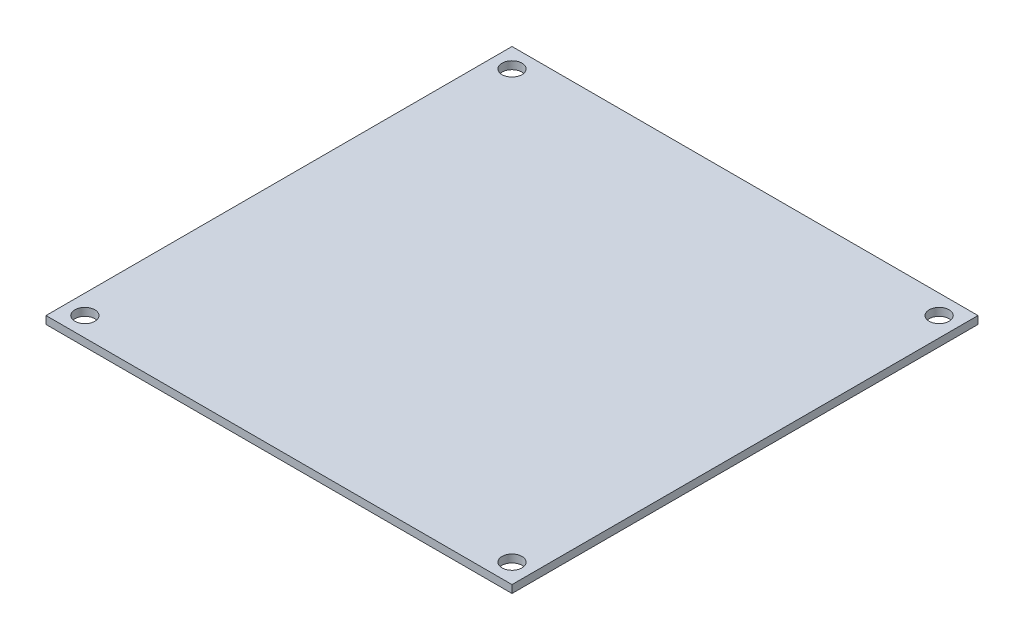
ISO-10303-21;
HEADER;
FILE_DESCRIPTION(('STEP AP214'),'2;1');
FILE_NAME('part.step','',(''),(''),'','','');
FILE_SCHEMA(('AUTOMOTIVE_DESIGN { 1 0 10303 214 1 1 1 1 }'));
ENDSEC;
DATA;
#1=APPLICATION_CONTEXT('core data for automotive mechanical design processes');
#2=APPLICATION_PROTOCOL_DEFINITION('international standard','automotive_design',2000,#1);
#3=PRODUCT_CONTEXT('',#1,'mechanical');
#4=PRODUCT('Part','Part','',(#3));
#5=PRODUCT_RELATED_PRODUCT_CATEGORY('part','',(#4));
#6=PRODUCT_DEFINITION_FORMATION('','',#4);
#7=PRODUCT_DEFINITION_CONTEXT('part definition',#1,'design');
#8=PRODUCT_DEFINITION('design','',#6,#7);
#9=PRODUCT_DEFINITION_SHAPE('','',#8);
#10=(LENGTH_UNIT() NAMED_UNIT(*) SI_UNIT(.MILLI.,.METRE.));
#11=(NAMED_UNIT(*) PLANE_ANGLE_UNIT() SI_UNIT($,.RADIAN.));
#12=(NAMED_UNIT(*) SI_UNIT($,.STERADIAN.) SOLID_ANGLE_UNIT());
#13=UNCERTAINTY_MEASURE_WITH_UNIT(LENGTH_MEASURE(1.E-05),#10,'distance_accuracy_value','');
#14=(GEOMETRIC_REPRESENTATION_CONTEXT(3) GLOBAL_UNCERTAINTY_ASSIGNED_CONTEXT((#13)) GLOBAL_UNIT_ASSIGNED_CONTEXT((#10,
#11,#12)) REPRESENTATION_CONTEXT('',''));
#15=CARTESIAN_POINT('',(0.,0.,0.));
#16=DIRECTION('',(0.,0.,1.));
#17=DIRECTION('',(1.,0.,0.));
#18=AXIS2_PLACEMENT_3D('',#15,#16,#17);
#19=CARTESIAN_POINT('',(0.,-1.27,0.));
#20=DIRECTION('',(-1.,0.,0.));
#21=DIRECTION('',(0.,0.,1.));
#22=AXIS2_PLACEMENT_3D('',#19,#20,#21);
#23=PLANE('',#22);
#24=DIRECTION('',(0.,0.,1.));
#25=VECTOR('',#24,1.);
#26=CARTESIAN_POINT('',(0.,0.,0.));
#27=LINE('',#26,#25);
#28=CARTESIAN_POINT('',(0.,0.,-76.2));
#29=VERTEX_POINT('',#28);
#30=CARTESIAN_POINT('',(0.,0.,0.));
#31=VERTEX_POINT('',#30);
#32=EDGE_CURVE('E99',#29,#31,#27,.T.);
#33=ORIENTED_EDGE('',*,*,#32,.F.);
#34=DIRECTION('',(0.,1.,0.));
#35=VECTOR('',#34,1.);
#36=CARTESIAN_POINT('',(0.,-1.27,-76.2));
#37=LINE('',#36,#35);
#38=CARTESIAN_POINT('',(0.,-1.27,-76.2));
#39=VERTEX_POINT('',#38);
#40=EDGE_CURVE('E11',#39,#29,#37,.T.);
#41=ORIENTED_EDGE('',*,*,#40,.F.);
#42=DIRECTION('',(0.,0.,1.));
#43=VECTOR('',#42,1.);
#44=CARTESIAN_POINT('',(0.,-1.27,0.));
#45=LINE('',#44,#43);
#46=CARTESIAN_POINT('',(0.,-1.27,0.));
#47=VERTEX_POINT('',#46);
#48=EDGE_CURVE('E92',#39,#47,#45,.T.);
#49=ORIENTED_EDGE('',*,*,#48,.T.);
#50=DIRECTION('',(0.,1.,0.));
#51=VECTOR('',#50,1.);
#52=CARTESIAN_POINT('',(0.,-1.27,0.));
#53=LINE('',#52,#51);
#54=EDGE_CURVE('E37',#47,#31,#53,.T.);
#55=ORIENTED_EDGE('',*,*,#54,.T.);
#56=EDGE_LOOP('',(#33,#41,#49,#55));
#57=FACE_BOUND('',#56,.T.);
#58=ADVANCED_FACE('F34',(#57),#23,.T.);
#59=CARTESIAN_POINT('',(0.,-1.27,-76.2));
#60=DIRECTION('',(0.,0.,-1.));
#61=DIRECTION('',(-1.,0.,0.));
#62=AXIS2_PLACEMENT_3D('',#59,#60,#61);
#63=PLANE('',#62);
#64=DIRECTION('',(-1.,0.,0.));
#65=VECTOR('',#64,1.);
#66=CARTESIAN_POINT('',(0.,0.,-76.2));
#67=LINE('',#66,#65);
#68=CARTESIAN_POINT('',(76.2,0.,-76.2));
#69=VERTEX_POINT('',#68);
#70=EDGE_CURVE('E94',#69,#29,#67,.T.);
#71=ORIENTED_EDGE('',*,*,#70,.F.);
#72=DIRECTION('',(0.,1.,0.));
#73=VECTOR('',#72,1.);
#74=CARTESIAN_POINT('',(76.2,-1.27,-76.2));
#75=LINE('',#74,#73);
#76=CARTESIAN_POINT('',(76.2,-1.27,-76.2));
#77=VERTEX_POINT('',#76);
#78=EDGE_CURVE('E43',#77,#69,#75,.T.);
#79=ORIENTED_EDGE('',*,*,#78,.F.);
#80=DIRECTION('',(-1.,0.,0.));
#81=VECTOR('',#80,1.);
#82=CARTESIAN_POINT('',(0.,-1.27,-76.2));
#83=LINE('',#82,#81);
#84=EDGE_CURVE('E89',#77,#39,#83,.T.);
#85=ORIENTED_EDGE('',*,*,#84,.T.);
#86=ORIENTED_EDGE('',*,*,#40,.T.);
#87=EDGE_LOOP('',(#71,#79,#85,#86));
#88=FACE_BOUND('',#87,.T.);
#89=ADVANCED_FACE('F110',(#88),#63,.T.);
#90=CARTESIAN_POINT('',(76.2,-1.27,0.));
#91=DIRECTION('',(1.,0.,0.));
#92=DIRECTION('',(0.,0.,-1.));
#93=AXIS2_PLACEMENT_3D('',#90,#91,#92);
#94=PLANE('',#93);
#95=DIRECTION('',(0.,0.,-1.));
#96=VECTOR('',#95,1.);
#97=CARTESIAN_POINT('',(76.2,0.,0.));
#98=LINE('',#97,#96);
#99=CARTESIAN_POINT('',(76.2,0.,0.));
#100=VERTEX_POINT('',#99);
#101=EDGE_CURVE('E84',#100,#69,#98,.T.);
#102=ORIENTED_EDGE('',*,*,#101,.F.);
#103=DIRECTION('',(0.,1.,0.));
#104=VECTOR('',#103,1.);
#105=CARTESIAN_POINT('',(76.2,-1.27,0.));
#106=LINE('',#105,#104);
#107=CARTESIAN_POINT('',(76.2,-1.27,0.));
#108=VERTEX_POINT('',#107);
#109=EDGE_CURVE('E79',#108,#100,#106,.T.);
#110=ORIENTED_EDGE('',*,*,#109,.F.);
#111=DIRECTION('',(0.,0.,-1.));
#112=VECTOR('',#111,1.);
#113=CARTESIAN_POINT('',(76.2,-1.27,0.));
#114=LINE('',#113,#112);
#115=EDGE_CURVE('E82',#108,#77,#114,.T.);
#116=ORIENTED_EDGE('',*,*,#115,.T.);
#117=ORIENTED_EDGE('',*,*,#78,.T.);
#118=EDGE_LOOP('',(#102,#110,#116,#117));
#119=FACE_BOUND('',#118,.T.);
#120=ADVANCED_FACE('F81',(#119),#94,.T.);
#121=CARTESIAN_POINT('',(0.,-1.27,0.));
#122=DIRECTION('',(0.,0.,1.));
#123=DIRECTION('',(1.,0.,0.));
#124=AXIS2_PLACEMENT_3D('',#121,#122,#123);
#125=PLANE('',#124);
#126=DIRECTION('',(1.,0.,0.));
#127=VECTOR('',#126,1.);
#128=CARTESIAN_POINT('',(0.,0.,0.));
#129=LINE('',#128,#127);
#130=EDGE_CURVE('E102',#31,#100,#129,.T.);
#131=ORIENTED_EDGE('',*,*,#130,.F.);
#132=ORIENTED_EDGE('',*,*,#54,.F.);
#133=DIRECTION('',(1.,0.,0.));
#134=VECTOR('',#133,1.);
#135=CARTESIAN_POINT('',(0.,-1.27,0.));
#136=LINE('',#135,#134);
#137=EDGE_CURVE('E88',#47,#108,#136,.T.);
#138=ORIENTED_EDGE('',*,*,#137,.T.);
#139=ORIENTED_EDGE('',*,*,#109,.T.);
#140=EDGE_LOOP('',(#131,#132,#138,#139));
#141=FACE_BOUND('',#140,.T.);
#142=ADVANCED_FACE('F91',(#141),#125,.T.);
#143=CARTESIAN_POINT('',(0.,-1.27,-76.2));
#144=DIRECTION('',(0.,-1.,0.));
#145=DIRECTION('',(0.,0.,-1.));
#146=AXIS2_PLACEMENT_3D('',#143,#144,#145);
#147=PLANE('',#146);
#148=CARTESIAN_POINT('',(73.0249999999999,-1.27,-3.1749999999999));
#149=DIRECTION('',(0.,-1.,0.));
#150=DIRECTION('',(0.,0.,-1.));
#151=AXIS2_PLACEMENT_3D('',#148,#149,#150);
#152=CIRCLE('',#151,1.63194999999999);
#153=CARTESIAN_POINT('',(73.0249999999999,-1.27,-4.80694999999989));
#154=VERTEX_POINT('',#153);
#155=EDGE_CURVE('E151',#154,#154,#152,.T.);
#156=ORIENTED_EDGE('',*,*,#155,.F.);
#157=EDGE_LOOP('',(#156));
#158=FACE_BOUND('',#157,.T.);
#159=CARTESIAN_POINT('',(3.17500000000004,-1.27,-73.025));
#160=DIRECTION('',(0.,-1.,0.));
#161=DIRECTION('',(0.,0.,-1.));
#162=AXIS2_PLACEMENT_3D('',#159,#160,#161);
#163=CIRCLE('',#162,1.63195);
#164=CARTESIAN_POINT('',(3.17500000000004,-1.27,-74.65695));
#165=VERTEX_POINT('',#164);
#166=EDGE_CURVE('E161',#165,#165,#163,.T.);
#167=ORIENTED_EDGE('',*,*,#166,.F.);
#168=EDGE_LOOP('',(#167));
#169=FACE_BOUND('',#168,.T.);
#170=CARTESIAN_POINT('',(3.17499999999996,-1.27,-3.17499999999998));
#171=DIRECTION('',(0.,-1.,0.));
#172=DIRECTION('',(0.,0.,-1.));
#173=AXIS2_PLACEMENT_3D('',#170,#171,#172);
#174=CIRCLE('',#173,1.63195);
#175=CARTESIAN_POINT('',(3.17499999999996,-1.27,-4.80694999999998));
#176=VERTEX_POINT('',#175);
#177=EDGE_CURVE('E167',#176,#176,#174,.T.);
#178=ORIENTED_EDGE('',*,*,#177,.F.);
#179=EDGE_LOOP('',(#178));
#180=FACE_BOUND('',#179,.T.);
#181=CARTESIAN_POINT('',(73.025,-1.27,-73.0249999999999));
#182=DIRECTION('',(0.,-1.,0.));
#183=DIRECTION('',(0.,0.,-1.));
#184=AXIS2_PLACEMENT_3D('',#181,#182,#183);
#185=CIRCLE('',#184,1.63194999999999);
#186=CARTESIAN_POINT('',(73.025,-1.27,-74.6569499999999));
#187=VERTEX_POINT('',#186);
#188=EDGE_CURVE('E103',#187,#187,#185,.T.);
#189=ORIENTED_EDGE('',*,*,#188,.F.);
#190=EDGE_LOOP('',(#189));
#191=FACE_BOUND('',#190,.T.);
#192=ORIENTED_EDGE('',*,*,#48,.F.);
#193=ORIENTED_EDGE('',*,*,#84,.F.);
#194=ORIENTED_EDGE('',*,*,#115,.F.);
#195=ORIENTED_EDGE('',*,*,#137,.F.);
#196=EDGE_LOOP('',(#192,#193,#194,#195));
#197=FACE_BOUND('',#196,.T.);
#198=ADVANCED_FACE('F87',(#158,#169,#180,#191,#197),#147,.T.);
#199=CARTESIAN_POINT('',(0.,0.,-76.2));
#200=DIRECTION('',(0.,-1.,0.));
#201=DIRECTION('',(0.,0.,-1.));
#202=AXIS2_PLACEMENT_3D('',#199,#200,#201);
#203=PLANE('',#202);
#204=CARTESIAN_POINT('',(73.0249999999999,0.,-3.1749999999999));
#205=DIRECTION('',(0.,1.,0.));
#206=DIRECTION('',(0.,0.,1.));
#207=AXIS2_PLACEMENT_3D('',#204,#205,#206);
#208=CIRCLE('',#207,1.63194999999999);
#209=CARTESIAN_POINT('',(73.0249999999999,0.,-1.54304999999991));
#210=VERTEX_POINT('',#209);
#211=EDGE_CURVE('E154',#210,#210,#208,.T.);
#212=ORIENTED_EDGE('',*,*,#211,.F.);
#213=EDGE_LOOP('',(#212));
#214=FACE_BOUND('',#213,.T.);
#215=CARTESIAN_POINT('',(3.17500000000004,0.,-73.025));
#216=DIRECTION('',(0.,1.,0.));
#217=DIRECTION('',(0.,0.,1.));
#218=AXIS2_PLACEMENT_3D('',#215,#216,#217);
#219=CIRCLE('',#218,1.63195);
#220=CARTESIAN_POINT('',(3.17500000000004,0.,-71.39305));
#221=VERTEX_POINT('',#220);
#222=EDGE_CURVE('E156',#221,#221,#219,.T.);
#223=ORIENTED_EDGE('',*,*,#222,.F.);
#224=EDGE_LOOP('',(#223));
#225=FACE_BOUND('',#224,.T.);
#226=CARTESIAN_POINT('',(3.17499999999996,0.,-3.17499999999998));
#227=DIRECTION('',(0.,1.,0.));
#228=DIRECTION('',(0.,0.,1.));
#229=AXIS2_PLACEMENT_3D('',#226,#227,#228);
#230=CIRCLE('',#229,1.63195);
#231=CARTESIAN_POINT('',(3.17499999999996,0.,-1.54304999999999));
#232=VERTEX_POINT('',#231);
#233=EDGE_CURVE('E164',#232,#232,#230,.T.);
#234=ORIENTED_EDGE('',*,*,#233,.F.);
#235=EDGE_LOOP('',(#234));
#236=FACE_BOUND('',#235,.T.);
#237=CARTESIAN_POINT('',(73.025,0.,-73.0249999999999));
#238=DIRECTION('',(0.,1.,0.));
#239=DIRECTION('',(0.,0.,1.));
#240=AXIS2_PLACEMENT_3D('',#237,#238,#239);
#241=CIRCLE('',#240,1.63194999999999);
#242=CARTESIAN_POINT('',(73.025,0.,-71.3930499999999));
#243=VERTEX_POINT('',#242);
#244=EDGE_CURVE('E170',#243,#243,#241,.T.);
#245=ORIENTED_EDGE('',*,*,#244,.F.);
#246=EDGE_LOOP('',(#245));
#247=FACE_BOUND('',#246,.T.);
#248=ORIENTED_EDGE('',*,*,#32,.T.);
#249=ORIENTED_EDGE('',*,*,#130,.T.);
#250=ORIENTED_EDGE('',*,*,#101,.T.);
#251=ORIENTED_EDGE('',*,*,#70,.T.);
#252=EDGE_LOOP('',(#248,#249,#250,#251));
#253=FACE_BOUND('',#252,.T.);
#254=ADVANCED_FACE('F109',(#214,#225,#236,#247,#253),#203,.F.);
#255=CARTESIAN_POINT('',(73.025,0.,-73.0249999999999));
#256=DIRECTION('',(0.,1.,0.));
#257=DIRECTION('',(0.,0.,1.));
#258=AXIS2_PLACEMENT_3D('',#255,#256,#257);
#259=CYLINDRICAL_SURFACE('',#258,1.63194999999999);
#260=ORIENTED_EDGE('',*,*,#188,.T.);
#261=EDGE_LOOP('',(#260));
#262=FACE_BOUND('',#261,.T.);
#263=ORIENTED_EDGE('',*,*,#244,.T.);
#264=EDGE_LOOP('',(#263));
#265=FACE_BOUND('',#264,.T.);
#266=ADVANCED_FACE('F128',(#262,#265),#259,.F.);
#267=CARTESIAN_POINT('',(3.17499999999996,0.,-3.17499999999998));
#268=DIRECTION('',(0.,1.,0.));
#269=DIRECTION('',(0.,0.,1.));
#270=AXIS2_PLACEMENT_3D('',#267,#268,#269);
#271=CYLINDRICAL_SURFACE('',#270,1.63195);
#272=ORIENTED_EDGE('',*,*,#177,.T.);
#273=EDGE_LOOP('',(#272));
#274=FACE_BOUND('',#273,.T.);
#275=ORIENTED_EDGE('',*,*,#233,.T.);
#276=EDGE_LOOP('',(#275));
#277=FACE_BOUND('',#276,.T.);
#278=ADVANCED_FACE('F135',(#274,#277),#271,.F.);
#279=CARTESIAN_POINT('',(3.17500000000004,0.,-73.025));
#280=DIRECTION('',(0.,1.,0.));
#281=DIRECTION('',(0.,0.,1.));
#282=AXIS2_PLACEMENT_3D('',#279,#280,#281);
#283=CYLINDRICAL_SURFACE('',#282,1.63195);
#284=ORIENTED_EDGE('',*,*,#166,.T.);
#285=EDGE_LOOP('',(#284));
#286=FACE_BOUND('',#285,.T.);
#287=ORIENTED_EDGE('',*,*,#222,.T.);
#288=EDGE_LOOP('',(#287));
#289=FACE_BOUND('',#288,.T.);
#290=ADVANCED_FACE('F139',(#286,#289),#283,.F.);
#291=CARTESIAN_POINT('',(73.0249999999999,0.,-3.1749999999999));
#292=DIRECTION('',(0.,1.,0.));
#293=DIRECTION('',(0.,0.,1.));
#294=AXIS2_PLACEMENT_3D('',#291,#292,#293);
#295=CYLINDRICAL_SURFACE('',#294,1.63194999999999);
#296=ORIENTED_EDGE('',*,*,#155,.T.);
#297=EDGE_LOOP('',(#296));
#298=FACE_BOUND('',#297,.T.);
#299=ORIENTED_EDGE('',*,*,#211,.T.);
#300=EDGE_LOOP('',(#299));
#301=FACE_BOUND('',#300,.T.);
#302=ADVANCED_FACE('F143',(#298,#301),#295,.F.);
#303=CLOSED_SHELL('',(#58,#89,#120,#142,#198,#254,#266,#278,#290,#302));
#304=MANIFOLD_SOLID_BREP('B2',#303);
#305=ADVANCED_BREP_SHAPE_REPRESENTATION('',(#18,#304),#14);
#306=SHAPE_DEFINITION_REPRESENTATION(#9,#305);
ENDSEC;
END-ISO-10303-21;
